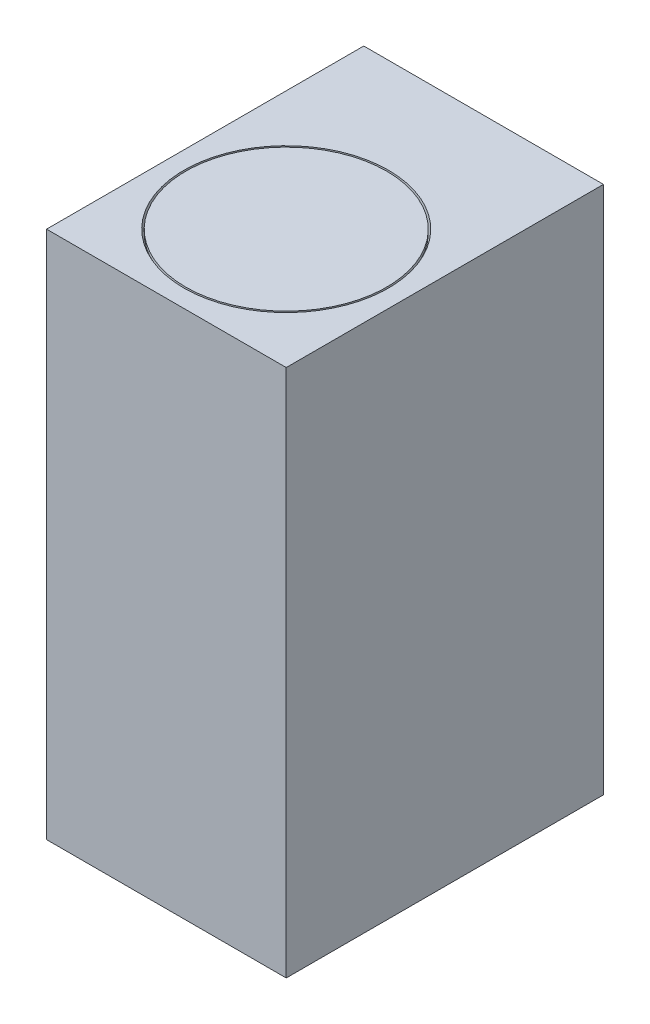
ISO-10303-21;
HEADER;
FILE_DESCRIPTION(('STEP AP214'),'2;1');
FILE_NAME('part.step','',(''),(''),'','','');
FILE_SCHEMA(('AUTOMOTIVE_DESIGN { 1 0 10303 214 1 1 1 1 }'));
ENDSEC;
DATA;
#1=APPLICATION_CONTEXT('core data for automotive mechanical design processes');
#2=APPLICATION_PROTOCOL_DEFINITION('international standard','automotive_design',2000,#1);
#3=PRODUCT_CONTEXT('',#1,'mechanical');
#4=PRODUCT('Part','Part','',(#3));
#5=PRODUCT_RELATED_PRODUCT_CATEGORY('part','',(#4));
#6=PRODUCT_DEFINITION_FORMATION('','',#4);
#7=PRODUCT_DEFINITION_CONTEXT('part definition',#1,'design');
#8=PRODUCT_DEFINITION('design','',#6,#7);
#9=PRODUCT_DEFINITION_SHAPE('','',#8);
#10=(LENGTH_UNIT() NAMED_UNIT(*) SI_UNIT(.MILLI.,.METRE.));
#11=(NAMED_UNIT(*) PLANE_ANGLE_UNIT() SI_UNIT($,.RADIAN.));
#12=(NAMED_UNIT(*) SI_UNIT($,.STERADIAN.) SOLID_ANGLE_UNIT());
#13=UNCERTAINTY_MEASURE_WITH_UNIT(LENGTH_MEASURE(1.E-05),#10,'distance_accuracy_value','');
#14=(GEOMETRIC_REPRESENTATION_CONTEXT(3) GLOBAL_UNCERTAINTY_ASSIGNED_CONTEXT((#13)) GLOBAL_UNIT_ASSIGNED_CONTEXT((#10,
#11,#12)) REPRESENTATION_CONTEXT('',''));
#15=CARTESIAN_POINT('',(0.,0.,0.));
#16=DIRECTION('',(0.,0.,1.));
#17=DIRECTION('',(1.,0.,0.));
#18=AXIS2_PLACEMENT_3D('',#15,#16,#17);
#19=CARTESIAN_POINT('',(34.,149.,56.));
#20=DIRECTION('',(0.,1.,0.));
#21=DIRECTION('',(0.,0.,1.));
#22=AXIS2_PLACEMENT_3D('',#19,#20,#21);
#23=CYLINDRICAL_SURFACE('',#22,28.5);
#24=CARTESIAN_POINT('',(34.,149.,56.));
#25=DIRECTION('',(0.,1.,0.));
#26=DIRECTION('',(0.,0.,1.));
#27=AXIS2_PLACEMENT_3D('',#24,#25,#26);
#28=CIRCLE('',#27,28.5);
#29=CARTESIAN_POINT('',(34.,149.,84.5));
#30=VERTEX_POINT('',#29);
#31=EDGE_CURVE('E11',#30,#30,#28,.T.);
#32=ORIENTED_EDGE('',*,*,#31,.T.);
#33=EDGE_LOOP('',(#32));
#34=FACE_BOUND('',#33,.T.);
#35=CARTESIAN_POINT('',(34.,150.,56.));
#36=DIRECTION('',(0.,1.,0.));
#37=DIRECTION('',(0.,0.,1.));
#38=AXIS2_PLACEMENT_3D('',#35,#36,#37);
#39=CIRCLE('',#38,28.5);
#40=CARTESIAN_POINT('',(34.,150.,84.5));
#41=VERTEX_POINT('',#40);
#42=EDGE_CURVE('E52',#41,#41,#39,.T.);
#43=ORIENTED_EDGE('',*,*,#42,.F.);
#44=EDGE_LOOP('',(#43));
#45=FACE_BOUND('',#44,.T.);
#46=ADVANCED_FACE('F49',(#34,#45),#23,.T.);
#47=CARTESIAN_POINT('',(34.,149.,56.));
#48=DIRECTION('',(0.,1.,0.));
#49=DIRECTION('',(0.,0.,1.));
#50=AXIS2_PLACEMENT_3D('',#47,#48,#49);
#51=PLANE('',#50);
#52=ORIENTED_EDGE('',*,*,#31,.F.);
#53=EDGE_LOOP('',(#52));
#54=FACE_BOUND('',#53,.T.);
#55=ADVANCED_FACE('F64',(#54),#51,.F.);
#56=CARTESIAN_POINT('',(34.,150.,56.));
#57=DIRECTION('',(0.,1.,0.));
#58=DIRECTION('',(0.,0.,1.));
#59=AXIS2_PLACEMENT_3D('',#56,#57,#58);
#60=PLANE('',#59);
#61=ORIENTED_EDGE('',*,*,#42,.T.);
#62=EDGE_LOOP('',(#61));
#63=FACE_BOUND('',#62,.T.);
#64=ADVANCED_FACE('F61',(#63),#60,.T.);
#65=CLOSED_SHELL('',(#46,#55,#64));
#66=MANIFOLD_SOLID_BREP('B2',#65);
#67=CARTESIAN_POINT('',(68.,0.,90.));
#68=DIRECTION('',(0.,1.,0.));
#69=DIRECTION('',(0.,0.,1.));
#70=AXIS2_PLACEMENT_3D('',#67,#68,#69);
#71=PLANE('',#70);
#72=DIRECTION('',(1.,0.,0.));
#73=VECTOR('',#72,1.);
#74=CARTESIAN_POINT('',(68.,0.,0.));
#75=LINE('',#74,#73);
#76=CARTESIAN_POINT('',(0.,0.,0.));
#77=VERTEX_POINT('',#76);
#78=CARTESIAN_POINT('',(68.,0.,0.));
#79=VERTEX_POINT('',#78);
#80=EDGE_CURVE('E158',#77,#79,#75,.T.);
#81=ORIENTED_EDGE('',*,*,#80,.T.);
#82=DIRECTION('',(0.,0.,-1.));
#83=VECTOR('',#82,1.);
#84=CARTESIAN_POINT('',(68.,0.,90.));
#85=LINE('',#84,#83);
#86=CARTESIAN_POINT('',(68.,0.,90.));
#87=VERTEX_POINT('',#86);
#88=EDGE_CURVE('E47',#87,#79,#85,.T.);
#89=ORIENTED_EDGE('',*,*,#88,.F.);
#90=DIRECTION('',(1.,0.,0.));
#91=VECTOR('',#90,1.);
#92=CARTESIAN_POINT('',(68.,0.,90.));
#93=LINE('',#92,#91);
#94=CARTESIAN_POINT('',(0.,0.,90.));
#95=VERTEX_POINT('',#94);
#96=EDGE_CURVE('E142',#95,#87,#93,.T.);
#97=ORIENTED_EDGE('',*,*,#96,.F.);
#98=DIRECTION('',(0.,0.,-1.));
#99=VECTOR('',#98,1.);
#100=CARTESIAN_POINT('',(0.,0.,90.));
#101=LINE('',#100,#99);
#102=EDGE_CURVE('E154',#95,#77,#101,.T.);
#103=ORIENTED_EDGE('',*,*,#102,.T.);
#104=EDGE_LOOP('',(#81,#89,#97,#103));
#105=FACE_BOUND('',#104,.T.);
#106=ADVANCED_FACE('F90',(#105),#71,.F.);
#107=CARTESIAN_POINT('',(68.,150.,90.));
#108=DIRECTION('',(-1.,0.,0.));
#109=DIRECTION('',(0.,0.,1.));
#110=AXIS2_PLACEMENT_3D('',#107,#108,#109);
#111=PLANE('',#110);
#112=DIRECTION('',(0.,1.,0.));
#113=VECTOR('',#112,1.);
#114=CARTESIAN_POINT('',(68.,150.,0.));
#115=LINE('',#114,#113);
#116=CARTESIAN_POINT('',(68.,150.,0.));
#117=VERTEX_POINT('',#116);
#118=EDGE_CURVE('E147',#79,#117,#115,.T.);
#119=ORIENTED_EDGE('',*,*,#118,.T.);
#120=DIRECTION('',(0.,0.,-1.));
#121=VECTOR('',#120,1.);
#122=CARTESIAN_POINT('',(68.,150.,90.));
#123=LINE('',#122,#121);
#124=CARTESIAN_POINT('',(68.,150.,90.));
#125=VERTEX_POINT('',#124);
#126=EDGE_CURVE('E99',#125,#117,#123,.T.);
#127=ORIENTED_EDGE('',*,*,#126,.F.);
#128=DIRECTION('',(0.,1.,0.));
#129=VECTOR('',#128,1.);
#130=CARTESIAN_POINT('',(68.,150.,90.));
#131=LINE('',#130,#129);
#132=EDGE_CURVE('E137',#87,#125,#131,.T.);
#133=ORIENTED_EDGE('',*,*,#132,.F.);
#134=ORIENTED_EDGE('',*,*,#88,.T.);
#135=EDGE_LOOP('',(#119,#127,#133,#134));
#136=FACE_BOUND('',#135,.T.);
#137=ADVANCED_FACE('F146',(#136),#111,.F.);
#138=CARTESIAN_POINT('',(0.,150.,90.));
#139=DIRECTION('',(0.,-1.,0.));
#140=DIRECTION('',(0.,0.,-1.));
#141=AXIS2_PLACEMENT_3D('',#138,#139,#140);
#142=PLANE('',#141);
#143=CARTESIAN_POINT('',(34.,150.,56.));
#144=DIRECTION('',(0.,1.,0.));
#145=DIRECTION('',(0.,0.,1.));
#146=AXIS2_PLACEMENT_3D('',#143,#144,#145);
#147=CIRCLE('',#146,29.);
#148=CARTESIAN_POINT('',(34.,150.,85.));
#149=VERTEX_POINT('',#148);
#150=EDGE_CURVE('E179',#149,#149,#147,.T.);
#151=ORIENTED_EDGE('',*,*,#150,.F.);
#152=EDGE_LOOP('',(#151));
#153=FACE_BOUND('',#152,.T.);
#154=DIRECTION('',(-1.,0.,0.));
#155=VECTOR('',#154,1.);
#156=CARTESIAN_POINT('',(0.,150.,0.));
#157=LINE('',#156,#155);
#158=CARTESIAN_POINT('',(0.,150.,0.));
#159=VERTEX_POINT('',#158);
#160=EDGE_CURVE('E124',#117,#159,#157,.T.);
#161=ORIENTED_EDGE('',*,*,#160,.T.);
#162=DIRECTION('',(0.,0.,-1.));
#163=VECTOR('',#162,1.);
#164=CARTESIAN_POINT('',(0.,150.,90.));
#165=LINE('',#164,#163);
#166=CARTESIAN_POINT('',(0.,150.,90.));
#167=VERTEX_POINT('',#166);
#168=EDGE_CURVE('E149',#167,#159,#165,.T.);
#169=ORIENTED_EDGE('',*,*,#168,.F.);
#170=DIRECTION('',(-1.,0.,0.));
#171=VECTOR('',#170,1.);
#172=CARTESIAN_POINT('',(0.,150.,90.));
#173=LINE('',#172,#171);
#174=EDGE_CURVE('E140',#125,#167,#173,.T.);
#175=ORIENTED_EDGE('',*,*,#174,.F.);
#176=ORIENTED_EDGE('',*,*,#126,.T.);
#177=EDGE_LOOP('',(#161,#169,#175,#176));
#178=FACE_BOUND('',#177,.T.);
#179=ADVANCED_FACE('F150',(#153,#178),#142,.F.);
#180=CARTESIAN_POINT('',(0.,0.,90.));
#181=DIRECTION('',(1.,0.,0.));
#182=DIRECTION('',(0.,0.,-1.));
#183=AXIS2_PLACEMENT_3D('',#180,#181,#182);
#184=PLANE('',#183);
#185=DIRECTION('',(0.,-1.,0.));
#186=VECTOR('',#185,1.);
#187=CARTESIAN_POINT('',(0.,0.,0.));
#188=LINE('',#187,#186);
#189=EDGE_CURVE('E130',#159,#77,#188,.T.);
#190=ORIENTED_EDGE('',*,*,#189,.T.);
#191=ORIENTED_EDGE('',*,*,#102,.F.);
#192=DIRECTION('',(0.,-1.,0.));
#193=VECTOR('',#192,1.);
#194=CARTESIAN_POINT('',(0.,0.,90.));
#195=LINE('',#194,#193);
#196=EDGE_CURVE('E107',#167,#95,#195,.T.);
#197=ORIENTED_EDGE('',*,*,#196,.F.);
#198=ORIENTED_EDGE('',*,*,#168,.T.);
#199=EDGE_LOOP('',(#190,#191,#197,#198));
#200=FACE_BOUND('',#199,.T.);
#201=ADVANCED_FACE('F172',(#200),#184,.F.);
#202=CARTESIAN_POINT('',(0.,0.,90.));
#203=DIRECTION('',(0.,0.,-1.));
#204=DIRECTION('',(-1.,0.,0.));
#205=AXIS2_PLACEMENT_3D('',#202,#203,#204);
#206=PLANE('',#205);
#207=ORIENTED_EDGE('',*,*,#96,.T.);
#208=ORIENTED_EDGE('',*,*,#132,.T.);
#209=ORIENTED_EDGE('',*,*,#174,.T.);
#210=ORIENTED_EDGE('',*,*,#196,.T.);
#211=EDGE_LOOP('',(#207,#208,#209,#210));
#212=FACE_BOUND('',#211,.T.);
#213=ADVANCED_FACE('F138',(#212),#206,.F.);
#214=CARTESIAN_POINT('',(0.,0.,0.));
#215=DIRECTION('',(0.,0.,-1.));
#216=DIRECTION('',(-1.,0.,0.));
#217=AXIS2_PLACEMENT_3D('',#214,#215,#216);
#218=PLANE('',#217);
#219=ORIENTED_EDGE('',*,*,#80,.F.);
#220=ORIENTED_EDGE('',*,*,#189,.F.);
#221=ORIENTED_EDGE('',*,*,#160,.F.);
#222=ORIENTED_EDGE('',*,*,#118,.F.);
#223=EDGE_LOOP('',(#219,#220,#221,#222));
#224=FACE_BOUND('',#223,.T.);
#225=ADVANCED_FACE('F175',(#224),#218,.T.);
#226=CARTESIAN_POINT('',(34.,60.,56.));
#227=DIRECTION('',(0.,1.,0.));
#228=DIRECTION('',(0.,0.,1.));
#229=AXIS2_PLACEMENT_3D('',#226,#227,#228);
#230=CYLINDRICAL_SURFACE('',#229,29.);
#231=CARTESIAN_POINT('',(34.,60.,56.));
#232=DIRECTION('',(0.,1.,0.));
#233=DIRECTION('',(0.,0.,1.));
#234=AXIS2_PLACEMENT_3D('',#231,#232,#233);
#235=CIRCLE('',#234,29.);
#236=CARTESIAN_POINT('',(34.,60.,85.));
#237=VERTEX_POINT('',#236);
#238=EDGE_CURVE('E162',#237,#237,#235,.T.);
#239=CARTESIAN_POINT('',(34.,60.,85.));
#240=CARTESIAN_POINT('',(34.,60.9375,85.));
#241=CARTESIAN_POINT('',(34.,61.875,85.));
#242=CARTESIAN_POINT('',(34.,63.75,85.));
#243=CARTESIAN_POINT('',(34.,64.6875,85.));
#244=CARTESIAN_POINT('',(34.,66.5625,85.));
#245=CARTESIAN_POINT('',(34.,67.5,85.));
#246=CARTESIAN_POINT('',(34.,69.375,85.));
#247=CARTESIAN_POINT('',(34.,70.3125,85.));
#248=CARTESIAN_POINT('',(34.,72.1875,85.));
#249=CARTESIAN_POINT('',(34.,73.125,85.));
#250=CARTESIAN_POINT('',(34.,75.,85.));
#251=CARTESIAN_POINT('',(34.,75.9375,85.));
#252=CARTESIAN_POINT('',(34.,77.8125,85.));
#253=CARTESIAN_POINT('',(34.,78.75,85.));
#254=CARTESIAN_POINT('',(34.,80.625,85.));
#255=CARTESIAN_POINT('',(34.,81.5625,85.));
#256=CARTESIAN_POINT('',(34.,83.4375,85.));
#257=CARTESIAN_POINT('',(34.,84.375,85.));
#258=CARTESIAN_POINT('',(34.,86.25,85.));
#259=CARTESIAN_POINT('',(34.,87.1875,85.));
#260=CARTESIAN_POINT('',(34.,89.0625,85.));
#261=CARTESIAN_POINT('',(34.,90.,85.));
#262=CARTESIAN_POINT('',(34.,91.875,85.));
#263=CARTESIAN_POINT('',(34.,92.8125,85.));
#264=CARTESIAN_POINT('',(34.,94.6875,85.));
#265=CARTESIAN_POINT('',(34.,95.625,85.));
#266=CARTESIAN_POINT('',(34.,97.5,85.));
#267=CARTESIAN_POINT('',(34.,98.4375,85.));
#268=CARTESIAN_POINT('',(34.,100.3125,85.));
#269=CARTESIAN_POINT('',(34.,101.25,85.));
#270=CARTESIAN_POINT('',(34.,103.125,85.));
#271=CARTESIAN_POINT('',(34.,104.0625,85.));
#272=CARTESIAN_POINT('',(34.,105.9375,85.));
#273=CARTESIAN_POINT('',(34.,106.875,85.));
#274=CARTESIAN_POINT('',(34.,108.75,85.));
#275=CARTESIAN_POINT('',(34.,109.6875,85.));
#276=CARTESIAN_POINT('',(34.,111.5625,85.));
#277=CARTESIAN_POINT('',(34.,112.5,85.));
#278=CARTESIAN_POINT('',(34.,114.375,85.));
#279=CARTESIAN_POINT('',(34.,115.3125,85.));
#280=CARTESIAN_POINT('',(34.,117.1875,85.));
#281=CARTESIAN_POINT('',(34.,118.125,85.));
#282=CARTESIAN_POINT('',(34.,120.,85.));
#283=CARTESIAN_POINT('',(34.,120.9375,85.));
#284=CARTESIAN_POINT('',(34.,122.8125,85.));
#285=CARTESIAN_POINT('',(34.,123.75,85.));
#286=CARTESIAN_POINT('',(34.,125.625,85.));
#287=CARTESIAN_POINT('',(34.,126.5625,85.));
#288=CARTESIAN_POINT('',(34.,128.4375,85.));
#289=CARTESIAN_POINT('',(34.,129.375,85.));
#290=CARTESIAN_POINT('',(34.,131.25,85.));
#291=CARTESIAN_POINT('',(34.,132.1875,85.));
#292=CARTESIAN_POINT('',(34.,134.0625,85.));
#293=CARTESIAN_POINT('',(34.,135.,85.));
#294=CARTESIAN_POINT('',(34.,136.875,85.));
#295=CARTESIAN_POINT('',(34.,137.8125,85.));
#296=CARTESIAN_POINT('',(34.,139.6875,85.));
#297=CARTESIAN_POINT('',(34.,140.625,85.));
#298=CARTESIAN_POINT('',(34.,142.5,85.));
#299=CARTESIAN_POINT('',(34.,143.4375,85.));
#300=CARTESIAN_POINT('',(34.,145.3125,85.));
#301=CARTESIAN_POINT('',(34.,146.25,85.));
#302=CARTESIAN_POINT('',(34.,148.125,85.));
#303=CARTESIAN_POINT('',(34.,149.0625,85.));
#304=CARTESIAN_POINT('',(34.,150.,85.));
#305=B_SPLINE_CURVE_WITH_KNOTS('',3,(#239,#240,#241,#242,#243,#244,#245,#246,#247,#248,#249,
#250,#251,#252,#253,#254,#255,#256,#257,#258,#259,#260,#261,#262,#263,#264,#265,#266,#267,#268,
#269,#270,#271,#272,#273,#274,#275,#276,#277,#278,#279,#280,#281,#282,#283,#284,#285,#286,#287,
#288,#289,#290,#291,#292,#293,#294,#295,#296,#297,#298,#299,#300,#301,#302,#303,#304),
.UNSPECIFIED.,.F.,.F.,(4,2,2,2,2,2,2,2,2,2,2,2,2,2,2,2,2,2,2,2,2,2,2,2,2,2,2,2,2,2,2,2,4),(0.,
2.8125,5.62499999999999,8.4375,11.25,14.0625,16.875,19.6875,22.5,25.3125,28.125,30.9375,33.75,
36.5625,39.375,42.1875,45.,47.8125,50.625,53.4375,56.25,59.0625,61.875,64.6875,67.5,70.3125,
73.125,75.9375,78.75,81.5625,84.375,87.1875,90.),.UNSPECIFIED.);
#306=EDGE_CURVE('BSEAM206',#237,#149,#305,.T.);
#307=ORIENTED_EDGE('',*,*,#238,.F.);
#308=ORIENTED_EDGE('',*,*,#150,.T.);
#309=ORIENTED_EDGE('',*,*,#306,.T.);
#310=ORIENTED_EDGE('',*,*,#306,.F.);
#311=EDGE_LOOP('',(#307,#309,#308,#310));
#312=FACE_BOUND('',#311,.T.);
#313=ADVANCED_FACE('F206',(#312),#230,.F.);
#314=CARTESIAN_POINT('',(34.,60.,56.));
#315=DIRECTION('',(0.,1.,0.));
#316=DIRECTION('',(0.,0.,1.));
#317=AXIS2_PLACEMENT_3D('',#314,#315,#316);
#318=PLANE('',#317);
#319=CARTESIAN_POINT('',(34.,60.,56.));
#320=DIRECTION('',(0.,1.,0.));
#321=DIRECTION('',(0.,0.,1.));
#322=AXIS2_PLACEMENT_3D('',#319,#320,#321);
#323=CIRCLE('',#322,28.);
#324=CARTESIAN_POINT('',(34.,60.,84.));
#325=VERTEX_POINT('',#324);
#326=EDGE_CURVE('E187',#325,#325,#323,.T.);
#327=ORIENTED_EDGE('',*,*,#326,.F.);
#328=EDGE_LOOP('',(#327));
#329=FACE_BOUND('',#328,.T.);
#330=ORIENTED_EDGE('',*,*,#238,.T.);
#331=EDGE_LOOP('',(#330));
#332=FACE_BOUND('',#331,.T.);
#333=ADVANCED_FACE('F200',(#329,#332),#318,.T.);
#334=CARTESIAN_POINT('',(34.,145.,56.));
#335=DIRECTION('',(0.,-1.,0.));
#336=DIRECTION('',(0.,0.,-1.));
#337=AXIS2_PLACEMENT_3D('',#334,#335,#336);
#338=CYLINDRICAL_SURFACE('',#337,28.);
#339=CARTESIAN_POINT('',(34.,145.,56.));
#340=DIRECTION('',(0.,1.,0.));
#341=DIRECTION('',(0.,0.,1.));
#342=AXIS2_PLACEMENT_3D('',#339,#340,#341);
#343=CIRCLE('',#342,28.);
#344=CARTESIAN_POINT('',(34.,145.,84.));
#345=VERTEX_POINT('',#344);
#346=EDGE_CURVE('E183',#345,#345,#343,.T.);
#347=ORIENTED_EDGE('',*,*,#346,.F.);
#348=EDGE_LOOP('',(#347));
#349=FACE_BOUND('',#348,.T.);
#350=ORIENTED_EDGE('',*,*,#326,.T.);
#351=EDGE_LOOP('',(#350));
#352=FACE_BOUND('',#351,.T.);
#353=ADVANCED_FACE('F197',(#349,#352),#338,.T.);
#354=CARTESIAN_POINT('',(34.,145.,56.));
#355=DIRECTION('',(0.,1.,0.));
#356=DIRECTION('',(0.,0.,1.));
#357=AXIS2_PLACEMENT_3D('',#354,#355,#356);
#358=PLANE('',#357);
#359=ORIENTED_EDGE('',*,*,#346,.T.);
#360=EDGE_LOOP('',(#359));
#361=FACE_BOUND('',#360,.T.);
#362=ADVANCED_FACE('F195',(#361),#358,.T.);
#363=CLOSED_SHELL('',(#106,#137,#179,#201,#213,#225,#313,#333,#353,#362));
#364=MANIFOLD_SOLID_BREP('B6',#363);
#365=ADVANCED_BREP_SHAPE_REPRESENTATION('',(#18,#66,#364),#14);
#366=SHAPE_DEFINITION_REPRESENTATION(#9,#365);
ENDSEC;
END-ISO-10303-21;
